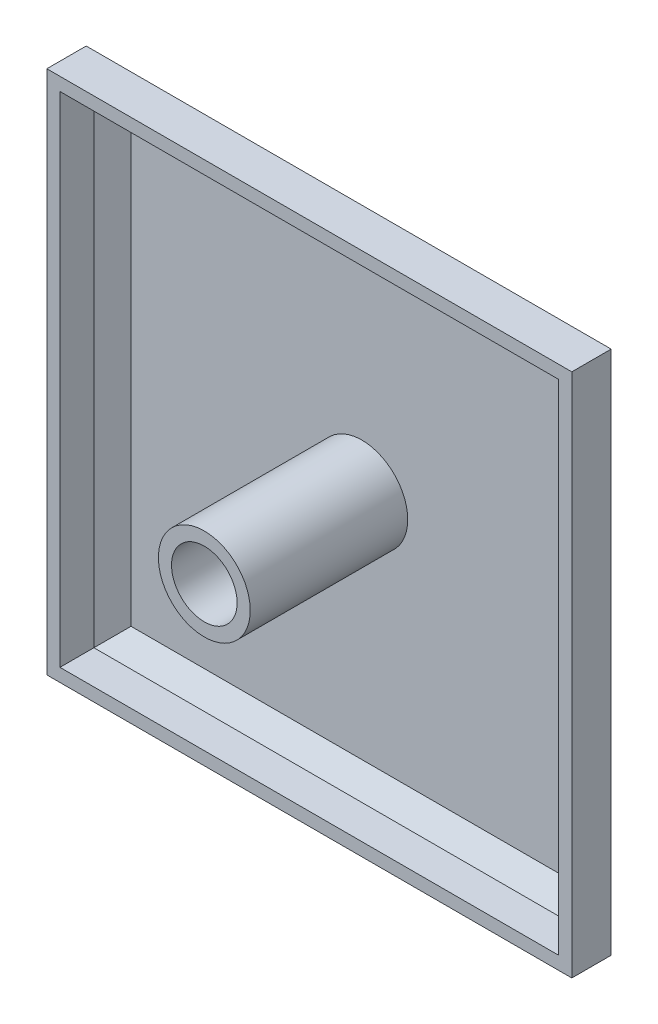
from build123d import *

# Parameters (mm, degrees)
SKETCH_1_W      = 40
SKETCH_1_H      = 40
EXTRUDE_1_DEPTH = 2.5
CHAMFER_1_SIZE  = 2
SHELL_1_T       = -1
SKETCH_2_R      = 3.5
SKETCH_2_R_2    = 2.5
EXTRUDE_2_DEPTH = 12


with BuildPart() as part:
    # Sketch 1 → Extrude 1 (new, symmetric)
    with BuildSketch(Plane.XY):
        Rectangle(SKETCH_1_W, SKETCH_1_H)
    extrude(amount=EXTRUDE_1_DEPTH, both=True)

    # Chamfer 1
    chamfer_1_edges = [part.edges().sort_by_distance(p)[0] for p in [
        (0, 20, -2.5),
        (20, 0, -2.5),
        (0, -20, -2.5),
        (-20, 0, -2.5),
    ]]
    chamfer(chamfer_1_edges, length=CHAMFER_1_SIZE)

    # Shell 1
    shell_1_openings = [part.faces().sort_by_distance(p)[0] for p in [
        (0, 0, 2.5),
    ]]
    offset(amount=SHELL_1_T, openings=shell_1_openings, kind=Kind.INTERSECTION)

    # Sketch 2 → Extrude 2 (add)
    with BuildSketch(Plane.XY.offset(-1.5)):
        Circle(SKETCH_2_R)
        Circle(SKETCH_2_R_2, mode=Mode.SUBTRACT)
    extrude(amount=EXTRUDE_2_DEPTH)


solid = part.part
